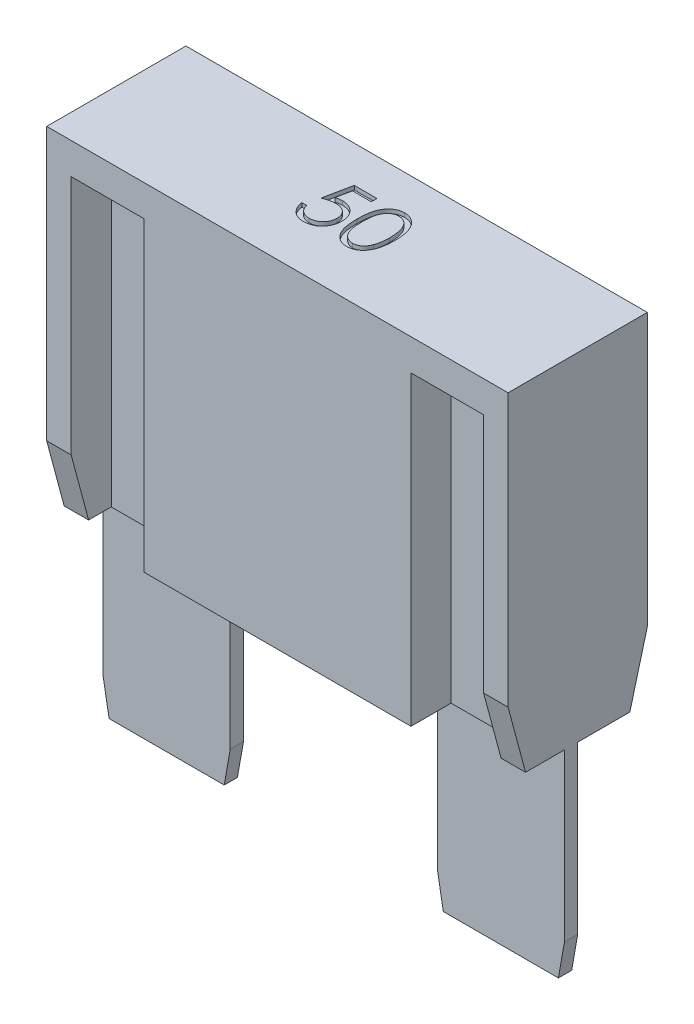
from build123d import *

# Parameters (mm, degrees)
SKETCH1_W               = 29.21
SKETCH1_H               = 21.3614
BOSS_EXTRUDE1_DEPTH     = 4.4069
SKETCH2_W               = 4.5974
SKETCH2_H               = 19.379848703
CUT_EXTRUDE1_DEPTH      = 2.54
MIRROR2_COPY_1_SKETCH_W = 4.5974
MIRROR2_COPY_1_SKETCH_H = 19.379848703
MIRROR2_COPY_1_DEPTH    = 2.54
CUT_EXTRUDE2_REACH      = 33.412
BOSS_EXTRUDE2_DEPTH     = 0.8382
CUT_EXTRUDE3_DEPTH      = 0.254


with BuildPart() as part:
    # Sketch1 → Boss-Extrude1 (new, symmetric)
    with BuildSketch(Plane.XY):
        Rectangle(SKETCH1_W, SKETCH1_H)
    extrude(amount=BOSS_EXTRUDE1_DEPTH, both=True)

    # Sketch2 → Cut-Extrude1 (cut)
    with BuildSketch(Plane.XY.offset(4.4069)):
        with Locations((-10.7569, -0.990775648)):
            Rectangle(SKETCH2_W, SKETCH2_H)
    cut_extrude1 = extrude(amount=-CUT_EXTRUDE1_DEPTH, mode=Mode.SUBTRACT)

    # Mirror1: Cut-Extrude1 across plane
    add(cut_extrude1.mirror(Plane(origin=(0, 0, 0), x_dir=(0, 0, 1), z_dir=(1, 0, 0))), mode=Mode.SUBTRACT)

    # Mirror2: Cut-Extrude1 across plane
    add(cut_extrude1.mirror(Plane.XY), mode=Mode.SUBTRACT)

    # Mirror2 copy 1 sketch → Mirror2 copy 1 (cut)
    with BuildSketch(Plane(origin=(0, 0, -4.4069), x_dir=(-1, 0, 0), z_dir=(0, 0, -1))):
        with Locations((-10.7569, -0.990775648)):
            Rectangle(MIRROR2_COPY_1_SKETCH_W, MIRROR2_COPY_1_SKETCH_H)
    extrude(amount=-MIRROR2_COPY_1_DEPTH, mode=Mode.SUBTRACT)

    # Sketch4 → Cut-Extrude2 (cut, up to next)
    with BuildSketch(Plane.ZY.offset(14.605), mode=Mode.PRIVATE) as cut_extrude2_sk1:
        Polygon((-3.302, -10.6807), (-4.4069, -6.557157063), (-7.83663316, -6.557157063), (-7.83663316, -10.6807), align=None)
    cut_extrude2_tool1 = extrude(cut_extrude2_sk1.sketch, amount=-CUT_EXTRUDE2_REACH, mode=Mode.PRIVATE) & part.part
    # Sketch4 → Cut-Extrude2 (cut, up to next)
    with BuildSketch(Plane.ZY.offset(14.605), mode=Mode.PRIVATE) as cut_extrude2_sk2:
        Polygon((3.302, -10.6807), (4.4069, -6.557157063), (6.998302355, -6.557157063), (6.998302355, -10.6807), align=None)
    cut_extrude2_tool2 = extrude(cut_extrude2_sk2.sketch, amount=-CUT_EXTRUDE2_REACH, mode=Mode.PRIVATE) & part.part
    cut_extrude2_1 = cut_extrude2_tool1.solids().sort_by_distance((-14.605, -8.714272, -5.832768))[0]
    add(cut_extrude2_1, mode=Mode.SUBTRACT)
    cut_extrude2_2 = cut_extrude2_tool2.solids().sort_by_distance((-14.605, -8.739696, 5.410196))[0]
    add(cut_extrude2_2, mode=Mode.SUBTRACT)
    cut_extrude2 = cut_extrude2_1 + cut_extrude2_2  # Cut-Extrude2 as one shape, for the pattern or mirror that repeats it

    # Mirror5: Cut-Extrude2 across plane
    add(cut_extrude2.mirror(Plane(origin=(0, 0, 0), x_dir=(0, 0, 1), z_dir=(1, 0, 0))), mode=Mode.SUBTRACT)

    # Sketch6 → Boss-Extrude2 (add)
    with BuildSketch(Plane.XY):
        Polygon((-14.605, -10.6807), (-6.5532, -10.6807), (-6.5532, -21.217083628), (-6.934703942, -23.3807), (-14.223496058, -23.3807), (-14.605, -21.217083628), align=None)
        Polygon((6.5532, -21.217083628), (6.934703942, -23.3807), (14.223496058, -23.3807), (14.605, -21.217083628), (14.605, -10.6807), (6.5532, -10.6807), align=None)
    extrude(amount=BOSS_EXTRUDE2_DEPTH)

    # Sketch3 → Cut-Extrude3 (cut)
    # profile 1 of 2: a face of its own
    with BuildSketch(Plane(origin=(0, 10.6807, 0), x_dir=(1, 0, 0), z_dir=(0, 1, 0))):
        with BuildLine():
            Line((-0.196598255, 2.094049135), (-0.196598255, 1.735074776))
            Line((-0.196598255, 1.735074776), (-1.387103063, 1.735074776))
            Line((-1.387103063, 1.735074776), (-1.575704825, 0.81450186))
            add(Edge.make_bspline(
                [(-1.575704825, 0.81450186), (-1.538648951, 0.824732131), (-1.466859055, 0.844551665), (-1.360899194, 0.866557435), (-1.260306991, 0.87982288), (-1.19503162, 0.88163419), (-1.16344521, 0.882510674)],
                knots=[0, 0, 0, 0, 1.100273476, 2.13160584, 3.095893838, 4, 4, 4, 4], degree=3))
            add(Edge.make_bspline(
                [(-1.16344521, 0.882510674), (-1.12436147, 0.881664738), (-1.047513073, 0.880001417), (-0.935074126, 0.864029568), (-0.827741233, 0.838889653), (-0.725738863, 0.803769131), (-0.628878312, 0.758859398), (-0.53805075, 0.702759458), (-0.451892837, 0.637226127), (-0.371950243, 0.561881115), (-0.299425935, 0.478959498), (-0.235659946, 0.389801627), (-0.181497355, 0.295273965), (-0.1379366, 0.194473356), (-0.103152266, 0.088514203), (-0.080000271, -0.02371838), (-0.064583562, -0.1411665), (-0.062861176, -0.22147107), (-0.06198287, -0.262421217)],
                knots=[0, 0, 0, 0, 1.052922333, 2.070308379, 3.05430497, 4.020497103, 4.973039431, 5.925935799, 6.892292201, 7.88610001, 8.88166317, 9.857072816, 10.836096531, 11.812156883, 12.81219415, 13.836441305, 14.89672472, 16, 16, 16, 16], degree=3))
            add(Edge.make_bspline(
                [(-0.06198287, -0.262421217), (-0.062647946, -0.290943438), (-0.063969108, -0.347602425), (-0.070687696, -0.431746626), (-0.083623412, -0.514109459), (-0.100991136, -0.594701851), (-0.123533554, -0.673371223), (-0.150822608, -0.750342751), (-0.184218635, -0.825137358), (-0.220850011, -0.898462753), (-0.262096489, -0.96866126), (-0.307874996, -1.034310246), (-0.356240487, -1.096394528), (-0.408281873, -1.154248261), (-0.464482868, -1.207491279), (-0.524162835, -1.25643956), (-0.586845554, -1.301920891), (-0.653500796, -1.342089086), (-0.722643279, -1.379052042), (-0.795271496, -1.409375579), (-0.869732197, -1.436486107), (-0.947097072, -1.458095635), (-1.027190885, -1.475028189), (-1.11014566, -1.48652879), (-1.19552633, -1.494905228), (-1.253401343, -1.495429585), (-1.282635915, -1.495694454)],
                knots=[0, 0, 0, 0, 1.056347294, 2.098418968, 3.122841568, 4.141288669, 5.149314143, 6.15115421, 7.162517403, 8.180376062, 9.185164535, 10.17417709, 11.141909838, 12.097768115, 13.052685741, 14.0056014, 14.954263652, 15.917497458, 16.885230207, 17.854509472, 18.828990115, 19.81800267, 20.826176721, 21.857883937, 22.917946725, 24, 24, 24, 24], degree=3))
            add(Edge.make_bspline(
                [(-1.282635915, -1.495694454), (-1.317510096, -1.495003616), (-1.386120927, -1.493644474), (-1.486641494, -1.479425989), (-1.583356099, -1.459062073), (-1.6754862, -1.428425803), (-1.763857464, -1.390038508), (-1.847280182, -1.341522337), (-1.927885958, -1.286543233), (-2.002397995, -1.22166288), (-2.071554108, -1.150747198), (-2.133460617, -1.073789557), (-2.188594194, -0.992060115), (-2.236071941, -0.905161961), (-2.276569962, -0.81332343), (-2.30838495, -0.716200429), (-2.334063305, -0.614300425), (-2.344926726, -0.544146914), (-2.350444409, -0.508514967)],
                knots=[0, 0, 0, 0, 1.0467383, 2.05933395, 3.04377827, 4.011590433, 4.970194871, 5.932262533, 6.905835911, 7.896367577, 8.894135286, 9.877477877, 10.858688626, 11.851381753, 12.8477658, 13.868841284, 14.917554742, 16, 16, 16, 16], degree=3))
            Line((-2.350444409, -0.508514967), (-2.036341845, -0.508514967))
            add(Edge.make_bspline(
                [(-2.036341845, -0.508514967), (-2.028613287, -0.54189142), (-2.013758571, -0.606042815), (-1.981152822, -0.696174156), (-1.941286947, -0.77649338), (-1.893882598, -0.848062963), (-1.837332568, -0.91047196), (-1.772803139, -0.966089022), (-1.700455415, -1.016264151), (-1.620062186, -1.058086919), (-1.535249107, -1.093755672), (-1.446481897, -1.117507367), (-1.35617755, -1.13420826), (-1.29509918, -1.135880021), (-1.264406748, -1.136720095)],
                knots=[0, 0, 0, 0, 1.136247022, 2.183929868, 3.172523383, 4.106158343, 5.02341133, 5.958108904, 6.928429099, 7.938127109, 8.96079061, 9.975095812, 10.982467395, 12, 12, 12, 12], degree=3))
            add(Edge.make_bspline(
                [(-1.264406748, -1.136720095), (-1.234448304, -1.135899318), (-1.175459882, -1.134283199), (-1.088648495, -1.121844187), (-1.004835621, -1.102686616), (-0.924848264, -1.074016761), (-0.847286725, -1.039172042), (-0.774112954, -0.994456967), (-0.703210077, -0.942996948), (-0.636781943, -0.884040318), (-0.575942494, -0.819070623), (-0.522186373, -0.74959323), (-0.47740946, -0.675476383), (-0.439675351, -0.598003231), (-0.411022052, -0.516324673), (-0.390581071, -0.430823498), (-0.378578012, -0.341288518), (-0.376926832, -0.280219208), (-0.376085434, -0.249099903)],
                knots=[0, 0, 0, 0, 1.027316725, 2.022795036, 3.002884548, 3.971462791, 4.93288096, 5.914575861, 6.907176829, 7.935150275, 8.956128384, 9.956726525, 10.942570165, 11.921478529, 12.907843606, 13.90538589, 14.932640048, 16, 16, 16, 16], degree=3))
            add(Edge.make_bspline(
                [(-0.376085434, -0.249099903), (-0.376743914, -0.221024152), (-0.378032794, -0.166069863), (-0.388563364, -0.085670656), (-0.406880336, -0.009597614), (-0.432304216, 0.06251662), (-0.464583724, 0.130740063), (-0.504030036, 0.195143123), (-0.551383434, 0.254876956), (-0.605475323, 0.30996951), (-0.664733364, 0.360814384), (-0.730177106, 0.404158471), (-0.800437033, 0.440622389), (-0.874666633, 0.472090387), (-0.954631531, 0.494691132), (-1.038748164, 0.511659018), (-1.127924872, 0.52147438), (-1.18889556, 0.522836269), (-1.220236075, 0.523536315)],
                knots=[0, 0, 0, 0, 1.045622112, 2.046656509, 3.013763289, 3.955457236, 4.890082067, 5.820317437, 6.762574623, 7.722996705, 8.69280354, 9.665887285, 10.63943826, 11.638615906, 12.663482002, 13.728887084, 14.832589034, 16, 16, 16, 16], degree=3))
            add(Edge.make_bspline(
                [(-1.220236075, 0.523536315), (-1.247365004, 0.522955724), (-1.303379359, 0.52175695), (-1.389302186, 0.512930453), (-1.479593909, 0.498691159), (-1.573908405, 0.479104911), (-1.672528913, 0.453473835), (-1.775247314, 0.422759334), (-1.88227958, 0.386037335), (-1.954397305, 0.358305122), (-1.99147005, 0.344049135)],
                knots=[0, 0, 0, 0, 0.817624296, 1.688186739, 2.600797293, 3.572016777, 4.590301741, 5.671205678, 6.80286297, 8, 8, 8, 8], degree=3))
            Line((-1.99147005, 0.344049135), (-1.632495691, 2.094049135))
            Line((-1.632495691, 2.094049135), (-0.196598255, 2.094049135))
        make_face()
    # profile 2 of 2: a face of its own
    with BuildSketch(Plane(origin=(0, 10.6807, 0), x_dir=(1, 0, 0), z_dir=(0, 1, 0))):
        with BuildLine():
            add(Edge.make_bspline(
                [(0.296991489, 0.342646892), (0.297319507, 0.398744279), (0.297956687, 0.507714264), (0.305045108, 0.666498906), (0.31682045, 0.815459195), (0.332957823, 0.954602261), (0.352595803, 1.083964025), (0.37881129, 1.203198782), (0.408624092, 1.312858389), (0.443176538, 1.413300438), (0.482164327, 1.505878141), (0.524598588, 1.592303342), (0.572163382, 1.672445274), (0.622140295, 1.747583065), (0.676552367, 1.816486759), (0.733851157, 1.880129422), (0.796273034, 1.937040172), (0.861696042, 1.988886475), (0.930712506, 2.034335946), (1.001355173, 2.074368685), (1.074110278, 2.108568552), (1.149176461, 2.135458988), (1.225879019, 2.157669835), (1.304486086, 2.172858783), (1.38512745, 2.182415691), (1.439558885, 2.183329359), (1.467163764, 2.183792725)],
                knots=[0, 0, 0, 0, 1.646270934, 3.197905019, 4.663502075, 6.030701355, 7.308322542, 8.50163776, 9.611534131, 10.641858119, 11.616356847, 12.558055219, 13.465016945, 14.349605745, 15.204443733, 16.039544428, 16.859896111, 17.680448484, 18.487036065, 19.28249412, 20.06191084, 20.843045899, 21.620316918, 22.403196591, 23.190181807, 24, 24, 24, 24], degree=3))
            add(Edge.make_bspline(
                [(1.467163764, 2.183792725), (1.494999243, 2.18330491), (1.550355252, 2.182334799), (1.632195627, 2.173010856), (1.712145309, 2.157539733), (1.789863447, 2.135618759), (1.865988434, 2.108423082), (1.939924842, 2.074335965), (2.012131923, 2.034657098), (2.081462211, 1.98803322), (2.148676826, 1.936050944), (2.212124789, 1.877288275), (2.271811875, 1.812338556), (2.32848718, 1.741896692), (2.380542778, 1.664611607), (2.43011621, 1.581827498), (2.474488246, 1.492096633), (2.517222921, 1.396916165), (2.554109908, 1.293652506), (2.587376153, 1.182887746), (2.614255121, 1.063313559), (2.636644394, 0.935557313), (2.65398929, 0.79914983), (2.666621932, 0.654383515), (2.673295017, 0.501163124), (2.674551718, 0.396405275), (2.675196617, 0.342646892)],
                knots=[0, 0, 0, 0, 0.810914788, 1.612654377, 2.396697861, 3.181598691, 3.963628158, 4.749916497, 5.551656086, 6.361998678, 7.18212741, 8.025565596, 8.878627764, 9.750805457, 10.657531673, 11.591944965, 12.560506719, 13.57287815, 14.630710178, 15.753379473, 16.941251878, 18.199788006, 19.531962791, 20.947069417, 22.433333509, 24, 24, 24, 24], degree=3))
            add(Edge.make_bspline(
                [(2.675196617, 0.342646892), (2.674545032, 0.289122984), (2.673275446, 0.184833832), (2.66669674, 0.032302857), (2.653738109, -0.111695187), (2.63752812, -0.247505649), (2.615077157, -0.374563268), (2.587471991, -0.493307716), (2.556821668, -0.604251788), (2.518986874, -0.7064866), (2.477576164, -0.801438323), (2.432520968, -0.890105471), (2.384251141, -0.973271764), (2.331662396, -1.050271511), (2.275608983, -1.121650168), (2.214891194, -1.18614779), (2.151220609, -1.245318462), (2.083808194, -1.29797009), (2.013396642, -1.344054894), (1.941437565, -1.385268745), (1.866654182, -1.41850144), (1.790741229, -1.447036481), (1.712612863, -1.468836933), (1.632366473, -1.483910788), (1.550410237, -1.494482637), (1.495008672, -1.495289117), (1.467163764, -1.495694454)],
                knots=[0, 0, 0, 0, 1.561518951, 3.042555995, 4.452378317, 5.7783523, 7.031515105, 8.214008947, 9.334062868, 10.386615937, 11.391082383, 12.354592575, 13.286541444, 14.194233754, 15.072674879, 15.931287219, 16.775624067, 17.606195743, 18.42308326, 19.229000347, 20.022332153, 20.807536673, 21.593273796, 22.3848459, 23.188221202, 24, 24, 24, 24], degree=3))
            add(Edge.make_bspline(
                [(1.467163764, -1.495694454), (1.43955965, -1.495228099), (1.385129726, -1.494308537), (1.3044773, -1.484794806), (1.226194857, -1.469499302), (1.149896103, -1.448082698), (1.075189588, -1.421867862), (1.003093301, -1.387714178), (0.932805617, -1.348380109), (0.864514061, -1.303584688), (0.7995019, -1.252263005), (0.737403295, -1.195498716), (0.679778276, -1.131875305), (0.62614418, -1.062397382), (0.575170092, -0.987704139), (0.528280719, -0.906775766), (0.484909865, -0.819933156), (0.445266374, -0.726615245), (0.41011771, -0.625460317), (0.379070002, -0.515311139), (0.354555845, -0.395195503), (0.33357289, -0.266078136), (0.316648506, -0.127404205), (0.305094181, 0.020901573), (0.297952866, 0.178746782), (0.297317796, 0.287016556), (0.296991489, 0.342646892)],
                knots=[0, 0, 0, 0, 0.810891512, 1.598919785, 2.382837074, 3.152667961, 3.926044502, 4.706494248, 5.493654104, 6.291793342, 7.103789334, 7.925228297, 8.761435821, 9.622817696, 10.50288917, 11.416980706, 12.369136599, 13.353924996, 14.394355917, 15.514179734, 16.714354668, 17.994756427, 19.357759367, 20.818452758, 22.365282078, 24, 24, 24, 24], degree=3))
        make_face()
        with BuildLine():
            add(Edge.make_bspline(
                [(0.611094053, 0.344049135), (0.6112135, 0.297300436), (0.611445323, 0.206570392), (0.617501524, 0.074727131), (0.625751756, -0.048243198), (0.636393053, -0.162496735), (0.652196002, -0.267646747), (0.669902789, -0.36441643), (0.691450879, -0.452293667), (0.716945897, -0.531881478), (0.745984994, -0.604530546), (0.777690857, -0.672131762), (0.81175158, -0.735483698), (0.849870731, -0.794017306), (0.891385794, -0.84792347), (0.935359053, -0.898156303), (0.983431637, -0.942953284), (1.04993538, -0.996680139), (1.137731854, -1.052199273), (1.24835231, -1.100545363), (1.362020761, -1.130927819), (1.439172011, -1.134791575), (1.477680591, -1.136720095)],
                knots=[0, 0, 0, 0, 1.459021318, 2.831673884, 4.118529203, 5.306027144, 6.411944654, 7.436330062, 8.375795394, 9.233974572, 10.042671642, 10.816086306, 11.563610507, 12.285937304, 12.993564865, 13.685989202, 14.367179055, 15.041617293, 16.353048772, 17.594441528, 18.799311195, 20, 20, 20, 20], degree=3))
            add(Edge.make_bspline(
                [(1.477680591, -1.136720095), (1.516438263, -1.135122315), (1.593873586, -1.131930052), (1.707007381, -1.101131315), (1.816837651, -1.054661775), (1.902909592, -0.99971427), (1.968392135, -0.94738594), (2.015309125, -0.902771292), (2.058371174, -0.852815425), (2.099213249, -0.798916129), (2.136672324, -0.740043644), (2.170735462, -0.676481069), (2.201818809, -0.608051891), (2.219527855, -0.560282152), (2.228582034, -0.535858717)],
                knots=[0, 0, 0, 0, 1.353760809, 2.704726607, 4.075137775, 5.516104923, 6.260822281, 7.007110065, 7.778089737, 8.566572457, 9.372053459, 10.217411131, 11.088608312, 12, 12, 12, 12], degree=3))
            add(Edge.make_bspline(
                [(2.228582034, -0.535858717), (2.239133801, -0.504628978), (2.260558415, -0.441219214), (2.28817019, -0.342855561), (2.309915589, -0.239652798), (2.329478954, -0.132227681), (2.34283201, -0.01978798), (2.353579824, 0.097318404), (2.359910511, 0.219179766), (2.360695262, 0.301974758), (2.361094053, 0.344049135)],
                knots=[0, 0, 0, 0, 0.884706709, 1.796334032, 2.740027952, 3.714592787, 4.726048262, 5.777819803, 6.87074269, 8, 8, 8, 8], degree=3))
            add(Edge.make_bspline(
                [(2.361094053, 0.344049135), (2.360543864, 0.386116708), (2.359467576, 0.468409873), (2.355353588, 0.588928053), (2.344730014, 0.703395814), (2.332930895, 0.812306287), (2.315533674, 0.91505659), (2.296775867, 1.012506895), (2.271574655, 1.10344992), (2.24465488, 1.189309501), (2.213844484, 1.269110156), (2.17992875, 1.343223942), (2.143706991, 1.412008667), (2.104364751, 1.475275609), (2.062369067, 1.533308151), (2.016611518, 1.584942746), (1.968907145, 1.631779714), (1.90208996, 1.685242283), (1.81461567, 1.739753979), (1.705770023, 1.789919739), (1.592499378, 1.818728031), (1.515925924, 1.822789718), (1.477680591, 1.824818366)],
                knots=[0, 0, 0, 0, 1.31362396, 2.569729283, 3.763502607, 4.902122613, 5.988968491, 7.01645872, 7.998833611, 8.933434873, 9.825090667, 10.667526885, 11.477055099, 12.250526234, 12.991942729, 13.710640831, 14.402115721, 15.076753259, 16.378508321, 17.609869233, 18.806226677, 20, 20, 20, 20], degree=3))
            add(Edge.make_bspline(
                [(1.477680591, 1.824818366), (1.438969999, 1.822786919), (1.361478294, 1.818720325), (1.247030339, 1.790027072), (1.137325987, 1.740014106), (1.050083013, 1.685061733), (0.983219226, 1.632723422), (0.936136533, 1.587336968), (0.89199036, 1.537690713), (0.85132266, 1.483288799), (0.813233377, 1.424823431), (0.778252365, 1.361834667), (0.746735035, 1.294003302), (0.717650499, 1.221386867), (0.692077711, 1.141805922), (0.670983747, 1.054036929), (0.651496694, 0.957575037), (0.637701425, 0.851855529), (0.62543767, 0.737573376), (0.617556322, 0.614296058), (0.611425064, 0.482231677), (0.6112066, 0.391032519), (0.611094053, 0.344049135)],
                knots=[0, 0, 0, 0, 1.207732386, 2.417664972, 3.655092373, 4.956220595, 5.625982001, 6.301752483, 6.994047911, 7.697131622, 8.419323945, 9.170223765, 9.943494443, 10.752040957, 11.610060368, 12.549350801, 13.567764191, 14.679664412, 15.874934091, 17.154273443, 18.533957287, 20, 20, 20, 20], degree=3))
        make_face(mode=Mode.SUBTRACT)
    extrude(amount=-CUT_EXTRUDE3_DEPTH, mode=Mode.SUBTRACT)


solid = part.part
